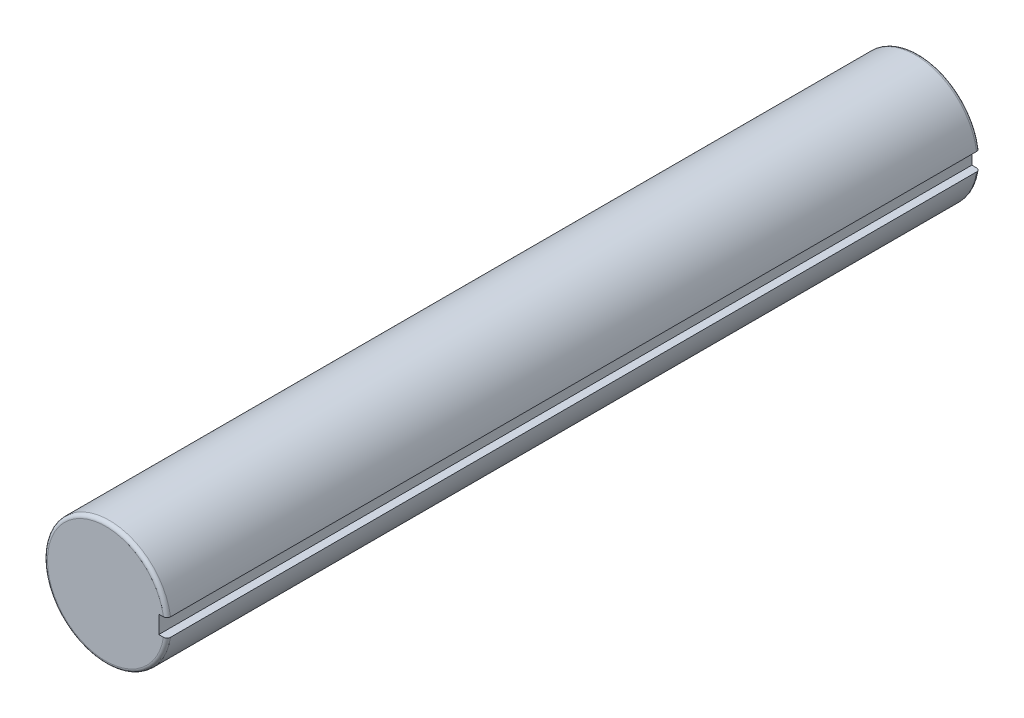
from build123d import *

# Parameters (mm, degrees)
BOSS_EXTRUDE1_DEPTH = 58.42
FILLET1_R           = 0.254


with BuildPart() as part:
    # Sketch1 → Boss-Extrude1 (new body)
    with BuildSketch(Plane.XY):
        with BuildLine():
            Line((3.81, -0.635), (3.81, 0.635))
            Line((3.81, 0.635), (4.399409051, 0.635))
            ThreePointArc((4.399409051, 0.635), (-4.445, 0), (4.399409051, -0.635))
            Line((4.399409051, -0.635), (3.81, -0.635))
        make_face()
    extrude(amount=BOSS_EXTRUDE1_DEPTH)

    # Fillet1
    fillet1_edges = [part.edges().sort_by_distance(p)[0] for p in [
        (-4.445, 0, 0),
        (-4.445, 0, 58.42),
    ]]
    fillet(fillet1_edges, radius=FILLET1_R)


solid = part.part
